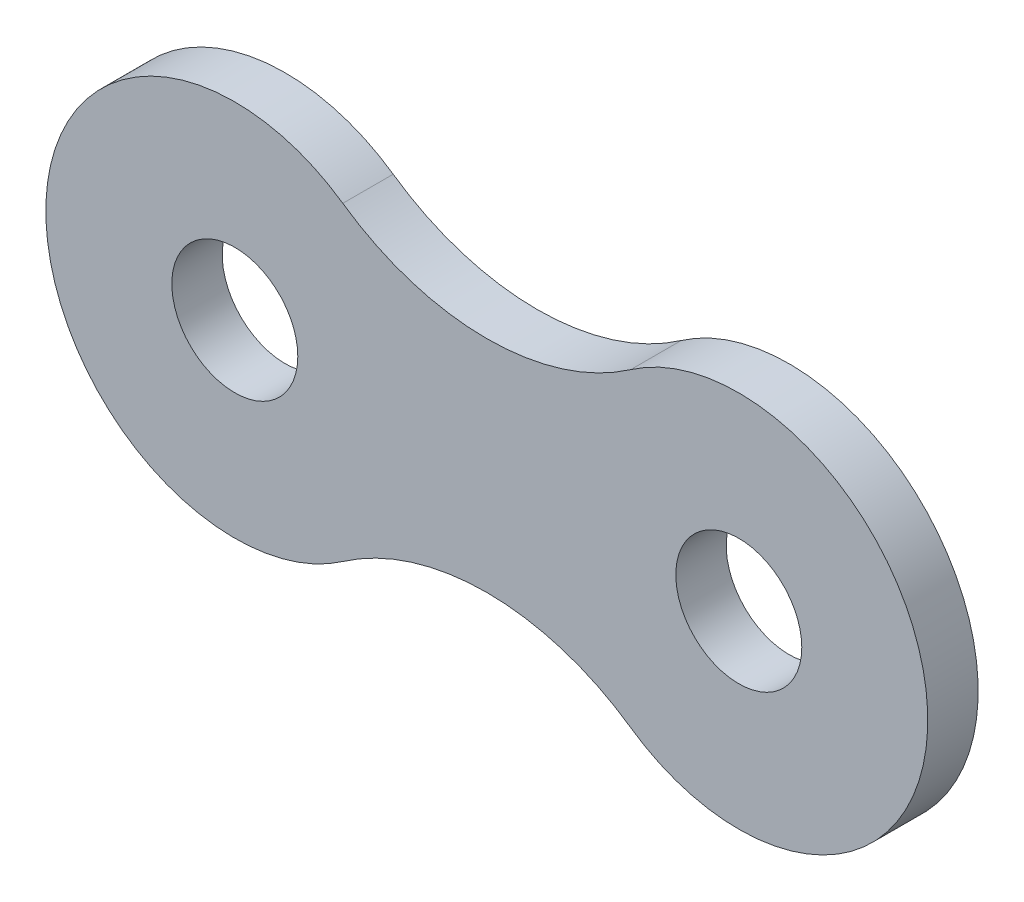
from build123d import *

# Parameters (mm, degrees)
SKIZZE1_R               = 2.5
LINEAR_AUSTRAGEN1_DEPTH = 2


with BuildPart() as part:
    # Skizze1 → Linear austragen1 (new body)
    with BuildSketch(Plane.XY):
        with BuildLine():
            ThreePointArc((4.285714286, 6.15488855), (-7.5, 0), (4.285714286, -6.15488855))
            ThreePointArc((4.285714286, -6.15488855), (10, -4.361406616), (15.714285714, -6.15488855))
            ThreePointArc((15.714285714, -6.15488855), (27.5, 0), (15.714285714, 6.15488855))
            ThreePointArc((15.714285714, 6.15488855), (10, 4.361406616), (4.285714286, 6.15488855))
        make_face()
        Circle(SKIZZE1_R, mode=Mode.SUBTRACT)
        with Locations((20, 0)):
            Circle(SKIZZE1_R, mode=Mode.SUBTRACT)
    extrude(amount=LINEAR_AUSTRAGEN1_DEPTH)


solid = part.part
